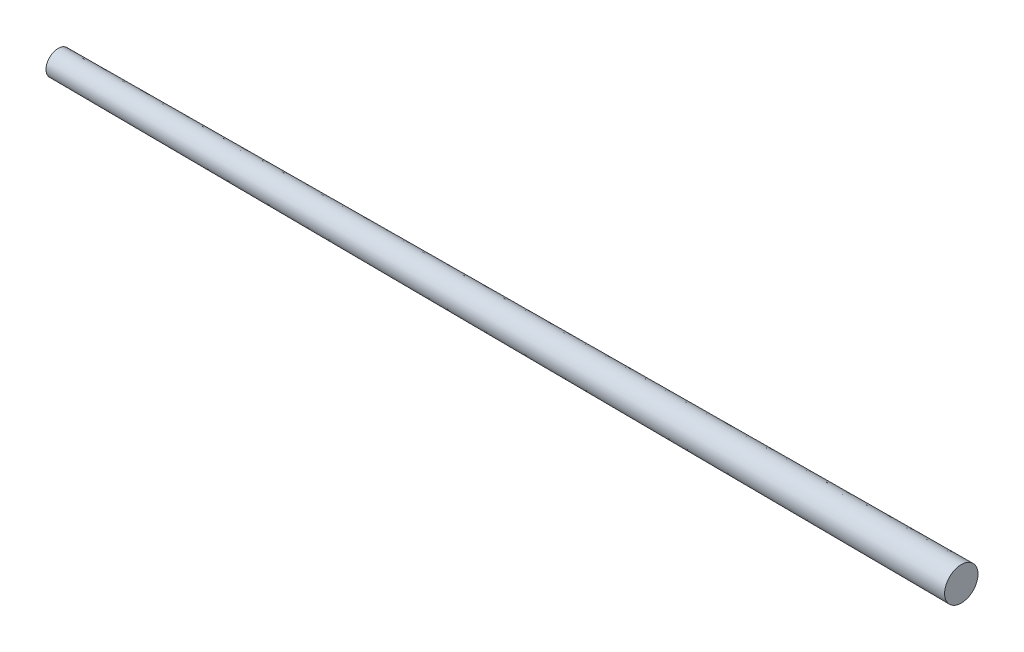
ISO-10303-21;
HEADER;
FILE_DESCRIPTION(('STEP AP214'),'2;1');
FILE_NAME('part.step','',(''),(''),'','','');
FILE_SCHEMA(('AUTOMOTIVE_DESIGN { 1 0 10303 214 1 1 1 1 }'));
ENDSEC;
DATA;
#1=APPLICATION_CONTEXT('core data for automotive mechanical design processes');
#2=APPLICATION_PROTOCOL_DEFINITION('international standard','automotive_design',2000,#1);
#3=PRODUCT_CONTEXT('',#1,'mechanical');
#4=PRODUCT('Part','Part','',(#3));
#5=PRODUCT_RELATED_PRODUCT_CATEGORY('part','',(#4));
#6=PRODUCT_DEFINITION_FORMATION('','',#4);
#7=PRODUCT_DEFINITION_CONTEXT('part definition',#1,'design');
#8=PRODUCT_DEFINITION('design','',#6,#7);
#9=PRODUCT_DEFINITION_SHAPE('','',#8);
#10=(LENGTH_UNIT() NAMED_UNIT(*) SI_UNIT(.MILLI.,.METRE.));
#11=(NAMED_UNIT(*) PLANE_ANGLE_UNIT() SI_UNIT($,.RADIAN.));
#12=(NAMED_UNIT(*) SI_UNIT($,.STERADIAN.) SOLID_ANGLE_UNIT());
#13=UNCERTAINTY_MEASURE_WITH_UNIT(LENGTH_MEASURE(1.E-05),#10,'distance_accuracy_value','');
#14=(GEOMETRIC_REPRESENTATION_CONTEXT(3) GLOBAL_UNCERTAINTY_ASSIGNED_CONTEXT((#13)) GLOBAL_UNIT_ASSIGNED_CONTEXT((#10,
#11,#12)) REPRESENTATION_CONTEXT('',''));
#15=CARTESIAN_POINT('',(0.,0.,0.));
#16=DIRECTION('',(0.,0.,1.));
#17=DIRECTION('',(1.,0.,0.));
#18=AXIS2_PLACEMENT_3D('',#15,#16,#17);
#19=CARTESIAN_POINT('',(0.,0.,0.));
#20=DIRECTION('',(1.,0.,0.));
#21=DIRECTION('',(0.,0.,-1.));
#22=AXIS2_PLACEMENT_3D('',#19,#20,#21);
#23=PLANE('',#22);
#24=CARTESIAN_POINT('',(0.,0.,0.));
#25=DIRECTION('',(1.,0.,0.));
#26=DIRECTION('',(0.,0.,-1.));
#27=AXIS2_PLACEMENT_3D('',#24,#25,#26);
#28=CIRCLE('',#27,1.35);
#29=CARTESIAN_POINT('',(0.,0.,-1.35));
#30=VERTEX_POINT('',#29);
#31=EDGE_CURVE('E5',#30,#30,#28,.T.);
#32=ORIENTED_EDGE('',*,*,#31,.F.);
#33=EDGE_LOOP('',(#32));
#34=FACE_BOUND('',#33,.T.);
#35=ADVANCED_FACE('F9',(#34),#23,.F.);
#36=CARTESIAN_POINT('',(0.,0.,0.));
#37=DIRECTION('',(1.,0.,0.));
#38=DIRECTION('',(0.,0.,-1.));
#39=AXIS2_PLACEMENT_3D('',#36,#37,#38);
#40=CONICAL_SURFACE('',#39,1.35,0.00499995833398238);
#41=CARTESIAN_POINT('',(100.,0.,0.));
#42=DIRECTION('',(1.,0.,0.));
#43=DIRECTION('',(0.,0.,-1.));
#44=AXIS2_PLACEMENT_3D('',#41,#42,#43);
#45=CIRCLE('',#44,1.85000000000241);
#46=CARTESIAN_POINT('',(100.,0.,-1.85000000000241));
#47=VERTEX_POINT('',#46);
#48=EDGE_CURVE('E20',#47,#47,#45,.T.);
#49=ORIENTED_EDGE('',*,*,#48,.F.);
#50=EDGE_LOOP('',(#49));
#51=FACE_BOUND('',#50,.T.);
#52=ORIENTED_EDGE('',*,*,#31,.T.);
#53=EDGE_LOOP('',(#52));
#54=FACE_BOUND('',#53,.T.);
#55=ADVANCED_FACE('F26',(#51,#54),#40,.T.);
#56=CARTESIAN_POINT('',(100.,1.85,0.));
#57=DIRECTION('',(-1.,0.,0.));
#58=DIRECTION('',(0.,0.,1.));
#59=AXIS2_PLACEMENT_3D('',#56,#57,#58);
#60=PLANE('',#59);
#61=ORIENTED_EDGE('',*,*,#48,.T.);
#62=EDGE_LOOP('',(#61));
#63=FACE_BOUND('',#62,.T.);
#64=ADVANCED_FACE('F35',(#63),#60,.F.);
#65=CLOSED_SHELL('',(#35,#55,#64));
#66=MANIFOLD_SOLID_BREP('B1',#65);
#67=ADVANCED_BREP_SHAPE_REPRESENTATION('',(#18,#66),#14);
#68=SHAPE_DEFINITION_REPRESENTATION(#9,#67);
ENDSEC;
END-ISO-10303-21;
